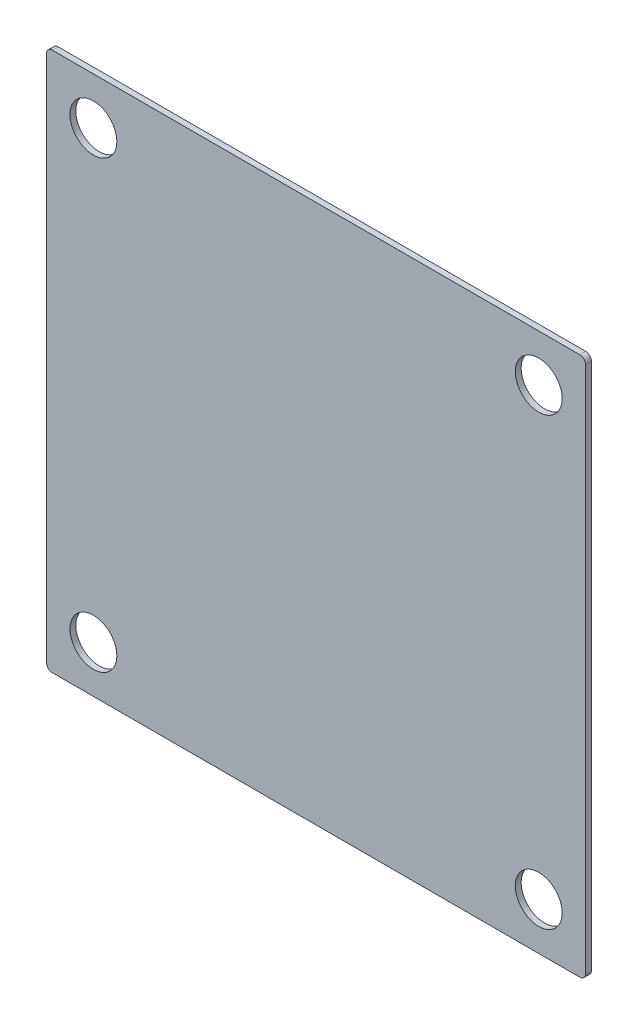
ISO-10303-21;
HEADER;
FILE_DESCRIPTION(('STEP AP214'),'2;1');
FILE_NAME('part.step','',(''),(''),'','','');
FILE_SCHEMA(('AUTOMOTIVE_DESIGN { 1 0 10303 214 1 1 1 1 }'));
ENDSEC;
DATA;
#1=APPLICATION_CONTEXT('core data for automotive mechanical design processes');
#2=APPLICATION_PROTOCOL_DEFINITION('international standard','automotive_design',2000,#1);
#3=PRODUCT_CONTEXT('',#1,'mechanical');
#4=PRODUCT('Part','Part','',(#3));
#5=PRODUCT_RELATED_PRODUCT_CATEGORY('part','',(#4));
#6=PRODUCT_DEFINITION_FORMATION('','',#4);
#7=PRODUCT_DEFINITION_CONTEXT('part definition',#1,'design');
#8=PRODUCT_DEFINITION('design','',#6,#7);
#9=PRODUCT_DEFINITION_SHAPE('','',#8);
#10=(LENGTH_UNIT() NAMED_UNIT(*) SI_UNIT(.MILLI.,.METRE.));
#11=(NAMED_UNIT(*) PLANE_ANGLE_UNIT() SI_UNIT($,.RADIAN.));
#12=(NAMED_UNIT(*) SI_UNIT($,.STERADIAN.) SOLID_ANGLE_UNIT());
#13=UNCERTAINTY_MEASURE_WITH_UNIT(LENGTH_MEASURE(1.E-05),#10,'distance_accuracy_value','');
#14=(GEOMETRIC_REPRESENTATION_CONTEXT(3) GLOBAL_UNCERTAINTY_ASSIGNED_CONTEXT((#13)) GLOBAL_UNIT_ASSIGNED_CONTEXT((#10,
#11,#12)) REPRESENTATION_CONTEXT('',''));
#15=CARTESIAN_POINT('',(0.,0.,0.));
#16=DIRECTION('',(0.,0.,1.));
#17=DIRECTION('',(1.,0.,0.));
#18=AXIS2_PLACEMENT_3D('',#15,#16,#17);
#19=CARTESIAN_POINT('',(-71.4375,-71.4375,1.5875));
#20=DIRECTION('',(0.,0.,1.));
#21=DIRECTION('',(1.,0.,0.));
#22=AXIS2_PLACEMENT_3D('',#19,#20,#21);
#23=PLANE('',#22);
#24=CARTESIAN_POINT('',(60.325,60.325,1.5875));
#25=DIRECTION('',(0.,0.,1.));
#26=DIRECTION('',(1.,0.,0.));
#27=AXIS2_PLACEMENT_3D('',#24,#25,#26);
#28=CIRCLE('',#27,6.35);
#29=CARTESIAN_POINT('',(66.675,60.325,1.5875));
#30=VERTEX_POINT('',#29);
#31=EDGE_CURVE('E195',#30,#30,#28,.T.);
#32=ORIENTED_EDGE('',*,*,#31,.F.);
#33=EDGE_LOOP('',(#32));
#34=FACE_BOUND('',#33,.T.);
#35=CARTESIAN_POINT('',(-60.325,-60.325,1.5875));
#36=DIRECTION('',(0.,0.,1.));
#37=DIRECTION('',(1.,0.,0.));
#38=AXIS2_PLACEMENT_3D('',#35,#36,#37);
#39=CIRCLE('',#38,6.35);
#40=CARTESIAN_POINT('',(-53.975,-60.325,1.5875));
#41=VERTEX_POINT('',#40);
#42=EDGE_CURVE('E141',#41,#41,#39,.T.);
#43=ORIENTED_EDGE('',*,*,#42,.F.);
#44=EDGE_LOOP('',(#43));
#45=FACE_BOUND('',#44,.T.);
#46=CARTESIAN_POINT('',(-71.4375,-71.4375,1.5875));
#47=DIRECTION('',(0.,0.,1.));
#48=DIRECTION('',(1.,0.,0.));
#49=AXIS2_PLACEMENT_3D('',#46,#47,#48);
#50=CIRCLE('',#49,1.58750000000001);
#51=CARTESIAN_POINT('',(-73.025,-71.4375,1.5875));
#52=VERTEX_POINT('',#51);
#53=CARTESIAN_POINT('',(-71.4375,-73.025,1.5875));
#54=VERTEX_POINT('',#53);
#55=EDGE_CURVE('E152',#52,#54,#50,.T.);
#56=ORIENTED_EDGE('',*,*,#55,.T.);
#57=DIRECTION('',(1.,0.,0.));
#58=VECTOR('',#57,1.);
#59=CARTESIAN_POINT('',(-71.4375,-73.025,1.5875));
#60=LINE('',#59,#58);
#61=CARTESIAN_POINT('',(71.4375,-73.025,1.5875));
#62=VERTEX_POINT('',#61);
#63=EDGE_CURVE('E100',#54,#62,#60,.T.);
#64=ORIENTED_EDGE('',*,*,#63,.T.);
#65=CARTESIAN_POINT('',(71.4375,-71.4375,1.5875));
#66=DIRECTION('',(0.,0.,1.));
#67=DIRECTION('',(1.,0.,0.));
#68=AXIS2_PLACEMENT_3D('',#65,#66,#67);
#69=CIRCLE('',#68,1.58750000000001);
#70=CARTESIAN_POINT('',(73.025,-71.4375,1.5875));
#71=VERTEX_POINT('',#70);
#72=EDGE_CURVE('E167',#62,#71,#69,.T.);
#73=ORIENTED_EDGE('',*,*,#72,.T.);
#74=DIRECTION('',(0.,1.,0.));
#75=VECTOR('',#74,1.);
#76=CARTESIAN_POINT('',(73.025,71.4375,1.5875));
#77=LINE('',#76,#75);
#78=CARTESIAN_POINT('',(73.025,71.4375,1.5875));
#79=VERTEX_POINT('',#78);
#80=EDGE_CURVE('E180',#71,#79,#77,.T.);
#81=ORIENTED_EDGE('',*,*,#80,.T.);
#82=CARTESIAN_POINT('',(71.4375,71.4375,1.5875));
#83=DIRECTION('',(0.,0.,1.));
#84=DIRECTION('',(-1.,0.,0.));
#85=AXIS2_PLACEMENT_3D('',#82,#83,#84);
#86=CIRCLE('',#85,1.58750000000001);
#87=CARTESIAN_POINT('',(71.4375,73.025,1.5875));
#88=VERTEX_POINT('',#87);
#89=EDGE_CURVE('E119',#79,#88,#86,.T.);
#90=ORIENTED_EDGE('',*,*,#89,.T.);
#91=DIRECTION('',(-1.,0.,0.));
#92=VECTOR('',#91,1.);
#93=CARTESIAN_POINT('',(-71.4375,73.025,1.5875));
#94=LINE('',#93,#92);
#95=CARTESIAN_POINT('',(-71.4375,73.025,1.5875));
#96=VERTEX_POINT('',#95);
#97=EDGE_CURVE('E113',#88,#96,#94,.T.);
#98=ORIENTED_EDGE('',*,*,#97,.T.);
#99=CARTESIAN_POINT('',(-71.4375,71.4375,1.5875));
#100=DIRECTION('',(0.,0.,1.));
#101=DIRECTION('',(1.,0.,0.));
#102=AXIS2_PLACEMENT_3D('',#99,#100,#101);
#103=CIRCLE('',#102,1.58750000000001);
#104=CARTESIAN_POINT('',(-73.025,71.4375,1.5875));
#105=VERTEX_POINT('',#104);
#106=EDGE_CURVE('E117',#96,#105,#103,.T.);
#107=ORIENTED_EDGE('',*,*,#106,.T.);
#108=DIRECTION('',(0.,-1.,0.));
#109=VECTOR('',#108,1.);
#110=CARTESIAN_POINT('',(-73.025,71.4375,1.5875));
#111=LINE('',#110,#109);
#112=EDGE_CURVE('E57',#105,#52,#111,.T.);
#113=ORIENTED_EDGE('',*,*,#112,.T.);
#114=EDGE_LOOP('',(#56,#64,#73,#81,#90,#98,#107,#113));
#115=FACE_BOUND('',#114,.T.);
#116=CARTESIAN_POINT('',(60.325,-60.325,1.5875));
#117=DIRECTION('',(0.,0.,1.));
#118=DIRECTION('',(1.,0.,0.));
#119=AXIS2_PLACEMENT_3D('',#116,#117,#118);
#120=CIRCLE('',#119,6.35);
#121=CARTESIAN_POINT('',(66.675,-60.325,1.5875));
#122=VERTEX_POINT('',#121);
#123=EDGE_CURVE('E189',#122,#122,#120,.T.);
#124=ORIENTED_EDGE('',*,*,#123,.F.);
#125=EDGE_LOOP('',(#124));
#126=FACE_BOUND('',#125,.T.);
#127=CARTESIAN_POINT('',(-60.325,60.325,1.5875));
#128=DIRECTION('',(0.,0.,1.));
#129=DIRECTION('',(1.,0.,0.));
#130=AXIS2_PLACEMENT_3D('',#127,#128,#129);
#131=CIRCLE('',#130,6.35);
#132=CARTESIAN_POINT('',(-53.975,60.325,1.5875));
#133=VERTEX_POINT('',#132);
#134=EDGE_CURVE('E201',#133,#133,#131,.T.);
#135=ORIENTED_EDGE('',*,*,#134,.F.);
#136=EDGE_LOOP('',(#135));
#137=FACE_BOUND('',#136,.T.);
#138=ADVANCED_FACE('F40',(#34,#45,#115,#126,#137),#23,.T.);
#139=CARTESIAN_POINT('',(-71.4375,-71.4375,0.));
#140=DIRECTION('',(0.,0.,1.));
#141=DIRECTION('',(1.,0.,0.));
#142=AXIS2_PLACEMENT_3D('',#139,#140,#141);
#143=PLANE('',#142);
#144=CARTESIAN_POINT('',(-71.4375,-71.4375,0.));
#145=DIRECTION('',(0.,0.,1.));
#146=DIRECTION('',(1.,0.,0.));
#147=AXIS2_PLACEMENT_3D('',#144,#145,#146);
#148=CIRCLE('',#147,1.58750000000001);
#149=CARTESIAN_POINT('',(-73.025,-71.4375,0.));
#150=VERTEX_POINT('',#149);
#151=CARTESIAN_POINT('',(-71.4375,-73.025,0.));
#152=VERTEX_POINT('',#151);
#153=EDGE_CURVE('E137',#150,#152,#148,.T.);
#154=ORIENTED_EDGE('',*,*,#153,.F.);
#155=DIRECTION('',(0.,-1.,0.));
#156=VECTOR('',#155,1.);
#157=CARTESIAN_POINT('',(-73.025,71.4375,0.));
#158=LINE('',#157,#156);
#159=CARTESIAN_POINT('',(-73.025,71.4375,0.));
#160=VERTEX_POINT('',#159);
#161=EDGE_CURVE('E92',#160,#150,#158,.T.);
#162=ORIENTED_EDGE('',*,*,#161,.F.);
#163=CARTESIAN_POINT('',(-71.4375,71.4375,0.));
#164=DIRECTION('',(0.,0.,1.));
#165=DIRECTION('',(1.,0.,0.));
#166=AXIS2_PLACEMENT_3D('',#163,#164,#165);
#167=CIRCLE('',#166,1.58750000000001);
#168=CARTESIAN_POINT('',(-71.4375,73.025,0.));
#169=VERTEX_POINT('',#168);
#170=EDGE_CURVE('E86',#169,#160,#167,.T.);
#171=ORIENTED_EDGE('',*,*,#170,.F.);
#172=DIRECTION('',(-1.,0.,0.));
#173=VECTOR('',#172,1.);
#174=CARTESIAN_POINT('',(-71.4375,73.025,0.));
#175=LINE('',#174,#173);
#176=CARTESIAN_POINT('',(71.4375,73.025,0.));
#177=VERTEX_POINT('',#176);
#178=EDGE_CURVE('E127',#177,#169,#175,.T.);
#179=ORIENTED_EDGE('',*,*,#178,.F.);
#180=CARTESIAN_POINT('',(71.4375,71.4375,0.));
#181=DIRECTION('',(0.,0.,1.));
#182=DIRECTION('',(-1.,0.,0.));
#183=AXIS2_PLACEMENT_3D('',#180,#181,#182);
#184=CIRCLE('',#183,1.58750000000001);
#185=CARTESIAN_POINT('',(73.025,71.4375,0.));
#186=VERTEX_POINT('',#185);
#187=EDGE_CURVE('E147',#186,#177,#184,.T.);
#188=ORIENTED_EDGE('',*,*,#187,.F.);
#189=DIRECTION('',(0.,1.,0.));
#190=VECTOR('',#189,1.);
#191=CARTESIAN_POINT('',(73.025,71.4375,0.));
#192=LINE('',#191,#190);
#193=CARTESIAN_POINT('',(73.025,-71.4375,0.));
#194=VERTEX_POINT('',#193);
#195=EDGE_CURVE('E145',#194,#186,#192,.T.);
#196=ORIENTED_EDGE('',*,*,#195,.F.);
#197=CARTESIAN_POINT('',(71.4375,-71.4375,0.));
#198=DIRECTION('',(0.,0.,1.));
#199=DIRECTION('',(1.,0.,0.));
#200=AXIS2_PLACEMENT_3D('',#197,#198,#199);
#201=CIRCLE('',#200,1.58750000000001);
#202=CARTESIAN_POINT('',(71.4375,-73.025,0.));
#203=VERTEX_POINT('',#202);
#204=EDGE_CURVE('E143',#203,#194,#201,.T.);
#205=ORIENTED_EDGE('',*,*,#204,.F.);
#206=DIRECTION('',(1.,0.,0.));
#207=VECTOR('',#206,1.);
#208=CARTESIAN_POINT('',(-71.4375,-73.025,0.));
#209=LINE('',#208,#207);
#210=EDGE_CURVE('E140',#152,#203,#209,.T.);
#211=ORIENTED_EDGE('',*,*,#210,.F.);
#212=EDGE_LOOP('',(#154,#162,#171,#179,#188,#196,#205,#211));
#213=FACE_BOUND('',#212,.T.);
#214=CARTESIAN_POINT('',(-60.325,-60.325,0.));
#215=DIRECTION('',(0.,0.,1.));
#216=DIRECTION('',(1.,0.,0.));
#217=AXIS2_PLACEMENT_3D('',#214,#215,#216);
#218=CIRCLE('',#217,6.35);
#219=CARTESIAN_POINT('',(-53.975,-60.325,0.));
#220=VERTEX_POINT('',#219);
#221=EDGE_CURVE('E186',#220,#220,#218,.T.);
#222=ORIENTED_EDGE('',*,*,#221,.T.);
#223=EDGE_LOOP('',(#222));
#224=FACE_BOUND('',#223,.T.);
#225=CARTESIAN_POINT('',(60.325,-60.325,0.));
#226=DIRECTION('',(0.,0.,1.));
#227=DIRECTION('',(1.,0.,0.));
#228=AXIS2_PLACEMENT_3D('',#225,#226,#227);
#229=CIRCLE('',#228,6.35);
#230=CARTESIAN_POINT('',(66.675,-60.325,0.));
#231=VERTEX_POINT('',#230);
#232=EDGE_CURVE('E192',#231,#231,#229,.T.);
#233=ORIENTED_EDGE('',*,*,#232,.T.);
#234=EDGE_LOOP('',(#233));
#235=FACE_BOUND('',#234,.T.);
#236=CARTESIAN_POINT('',(60.325,60.325,0.));
#237=DIRECTION('',(0.,0.,1.));
#238=DIRECTION('',(1.,0.,0.));
#239=AXIS2_PLACEMENT_3D('',#236,#237,#238);
#240=CIRCLE('',#239,6.35);
#241=CARTESIAN_POINT('',(66.675,60.325,0.));
#242=VERTEX_POINT('',#241);
#243=EDGE_CURVE('E198',#242,#242,#240,.T.);
#244=ORIENTED_EDGE('',*,*,#243,.T.);
#245=EDGE_LOOP('',(#244));
#246=FACE_BOUND('',#245,.T.);
#247=CARTESIAN_POINT('',(-60.325,60.325,0.));
#248=DIRECTION('',(0.,0.,1.));
#249=DIRECTION('',(1.,0.,0.));
#250=AXIS2_PLACEMENT_3D('',#247,#248,#249);
#251=CIRCLE('',#250,6.35);
#252=CARTESIAN_POINT('',(-53.975,60.325,0.));
#253=VERTEX_POINT('',#252);
#254=EDGE_CURVE('E204',#253,#253,#251,.T.);
#255=ORIENTED_EDGE('',*,*,#254,.T.);
#256=EDGE_LOOP('',(#255));
#257=FACE_BOUND('',#256,.T.);
#258=ADVANCED_FACE('F171',(#213,#224,#235,#246,#257),#143,.F.);
#259=CARTESIAN_POINT('',(-71.4375,-71.4375,1.5875));
#260=DIRECTION('',(0.,0.,-1.));
#261=DIRECTION('',(-1.,0.,0.));
#262=AXIS2_PLACEMENT_3D('',#259,#260,#261);
#263=CYLINDRICAL_SURFACE('',#262,1.58750000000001);
#264=ORIENTED_EDGE('',*,*,#153,.T.);
#265=DIRECTION('',(0.,0.,-1.));
#266=VECTOR('',#265,1.);
#267=CARTESIAN_POINT('',(-71.4375,-73.025,1.5875));
#268=LINE('',#267,#266);
#269=EDGE_CURVE('E11',#54,#152,#268,.T.);
#270=ORIENTED_EDGE('',*,*,#269,.F.);
#271=ORIENTED_EDGE('',*,*,#55,.F.);
#272=DIRECTION('',(0.,0.,-1.));
#273=VECTOR('',#272,1.);
#274=CARTESIAN_POINT('',(-73.025,-71.4375,1.5875));
#275=LINE('',#274,#273);
#276=EDGE_CURVE('E133',#52,#150,#275,.T.);
#277=ORIENTED_EDGE('',*,*,#276,.T.);
#278=EDGE_LOOP('',(#264,#270,#271,#277));
#279=FACE_BOUND('',#278,.T.);
#280=ADVANCED_FACE('F42',(#279),#263,.T.);
#281=CARTESIAN_POINT('',(-71.4375,-73.025,1.5875));
#282=DIRECTION('',(0.,1.,0.));
#283=DIRECTION('',(0.,0.,1.));
#284=AXIS2_PLACEMENT_3D('',#281,#282,#283);
#285=PLANE('',#284);
#286=ORIENTED_EDGE('',*,*,#210,.T.);
#287=DIRECTION('',(0.,0.,-1.));
#288=VECTOR('',#287,1.);
#289=CARTESIAN_POINT('',(71.4375,-73.025,1.5875));
#290=LINE('',#289,#288);
#291=EDGE_CURVE('E49',#62,#203,#290,.T.);
#292=ORIENTED_EDGE('',*,*,#291,.F.);
#293=ORIENTED_EDGE('',*,*,#63,.F.);
#294=ORIENTED_EDGE('',*,*,#269,.T.);
#295=EDGE_LOOP('',(#286,#292,#293,#294));
#296=FACE_BOUND('',#295,.T.);
#297=ADVANCED_FACE('F238',(#296),#285,.F.);
#298=CARTESIAN_POINT('',(71.4375,-71.4375,1.5875));
#299=DIRECTION('',(0.,0.,-1.));
#300=DIRECTION('',(-1.,0.,0.));
#301=AXIS2_PLACEMENT_3D('',#298,#299,#300);
#302=CYLINDRICAL_SURFACE('',#301,1.58750000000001);
#303=ORIENTED_EDGE('',*,*,#204,.T.);
#304=DIRECTION('',(0.,0.,-1.));
#305=VECTOR('',#304,1.);
#306=CARTESIAN_POINT('',(73.025,-71.4375,1.5875));
#307=LINE('',#306,#305);
#308=EDGE_CURVE('E159',#71,#194,#307,.T.);
#309=ORIENTED_EDGE('',*,*,#308,.F.);
#310=ORIENTED_EDGE('',*,*,#72,.F.);
#311=ORIENTED_EDGE('',*,*,#291,.T.);
#312=EDGE_LOOP('',(#303,#309,#310,#311));
#313=FACE_BOUND('',#312,.T.);
#314=ADVANCED_FACE('F165',(#313),#302,.T.);
#315=CARTESIAN_POINT('',(73.025,71.4375,1.5875));
#316=DIRECTION('',(-1.,0.,0.));
#317=DIRECTION('',(0.,0.,1.));
#318=AXIS2_PLACEMENT_3D('',#315,#316,#317);
#319=PLANE('',#318);
#320=ORIENTED_EDGE('',*,*,#195,.T.);
#321=DIRECTION('',(0.,0.,-1.));
#322=VECTOR('',#321,1.);
#323=CARTESIAN_POINT('',(73.025,71.4375,1.5875));
#324=LINE('',#323,#322);
#325=EDGE_CURVE('E156',#79,#186,#324,.T.);
#326=ORIENTED_EDGE('',*,*,#325,.F.);
#327=ORIENTED_EDGE('',*,*,#80,.F.);
#328=ORIENTED_EDGE('',*,*,#308,.T.);
#329=EDGE_LOOP('',(#320,#326,#327,#328));
#330=FACE_BOUND('',#329,.T.);
#331=ADVANCED_FACE('F176',(#330),#319,.F.);
#332=CARTESIAN_POINT('',(71.4375,71.4375,1.5875));
#333=DIRECTION('',(0.,0.,-1.));
#334=DIRECTION('',(-1.,0.,0.));
#335=AXIS2_PLACEMENT_3D('',#332,#333,#334);
#336=CYLINDRICAL_SURFACE('',#335,1.58750000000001);
#337=ORIENTED_EDGE('',*,*,#187,.T.);
#338=DIRECTION('',(0.,0.,-1.));
#339=VECTOR('',#338,1.);
#340=CARTESIAN_POINT('',(71.4375,73.025,1.5875));
#341=LINE('',#340,#339);
#342=EDGE_CURVE('E128',#88,#177,#341,.T.);
#343=ORIENTED_EDGE('',*,*,#342,.F.);
#344=ORIENTED_EDGE('',*,*,#89,.F.);
#345=ORIENTED_EDGE('',*,*,#325,.T.);
#346=EDGE_LOOP('',(#337,#343,#344,#345));
#347=FACE_BOUND('',#346,.T.);
#348=ADVANCED_FACE('F179',(#347),#336,.T.);
#349=CARTESIAN_POINT('',(-71.4375,73.025,1.5875));
#350=DIRECTION('',(0.,-1.,0.));
#351=DIRECTION('',(0.,0.,-1.));
#352=AXIS2_PLACEMENT_3D('',#349,#350,#351);
#353=PLANE('',#352);
#354=ORIENTED_EDGE('',*,*,#178,.T.);
#355=DIRECTION('',(0.,0.,-1.));
#356=VECTOR('',#355,1.);
#357=CARTESIAN_POINT('',(-71.4375,73.025,1.5875));
#358=LINE('',#357,#356);
#359=EDGE_CURVE('E124',#96,#169,#358,.T.);
#360=ORIENTED_EDGE('',*,*,#359,.F.);
#361=ORIENTED_EDGE('',*,*,#97,.F.);
#362=ORIENTED_EDGE('',*,*,#342,.T.);
#363=EDGE_LOOP('',(#354,#360,#361,#362));
#364=FACE_BOUND('',#363,.T.);
#365=ADVANCED_FACE('F125',(#364),#353,.F.);
#366=CARTESIAN_POINT('',(-71.4375,71.4375,1.5875));
#367=DIRECTION('',(0.,0.,-1.));
#368=DIRECTION('',(-1.,0.,0.));
#369=AXIS2_PLACEMENT_3D('',#366,#367,#368);
#370=CYLINDRICAL_SURFACE('',#369,1.58750000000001);
#371=ORIENTED_EDGE('',*,*,#170,.T.);
#372=DIRECTION('',(0.,0.,-1.));
#373=VECTOR('',#372,1.);
#374=CARTESIAN_POINT('',(-73.025,71.4375,1.5875));
#375=LINE('',#374,#373);
#376=EDGE_CURVE('E129',#105,#160,#375,.T.);
#377=ORIENTED_EDGE('',*,*,#376,.F.);
#378=ORIENTED_EDGE('',*,*,#106,.F.);
#379=ORIENTED_EDGE('',*,*,#359,.T.);
#380=EDGE_LOOP('',(#371,#377,#378,#379));
#381=FACE_BOUND('',#380,.T.);
#382=ADVANCED_FACE('F131',(#381),#370,.T.);
#383=CARTESIAN_POINT('',(-73.025,71.4375,1.5875));
#384=DIRECTION('',(1.,0.,0.));
#385=DIRECTION('',(0.,0.,-1.));
#386=AXIS2_PLACEMENT_3D('',#383,#384,#385);
#387=PLANE('',#386);
#388=ORIENTED_EDGE('',*,*,#161,.T.);
#389=ORIENTED_EDGE('',*,*,#276,.F.);
#390=ORIENTED_EDGE('',*,*,#112,.F.);
#391=ORIENTED_EDGE('',*,*,#376,.T.);
#392=EDGE_LOOP('',(#388,#389,#390,#391));
#393=FACE_BOUND('',#392,.T.);
#394=ADVANCED_FACE('F226',(#393),#387,.F.);
#395=CARTESIAN_POINT('',(-60.325,-60.325,1.5875));
#396=DIRECTION('',(0.,0.,-1.));
#397=DIRECTION('',(-1.,0.,0.));
#398=AXIS2_PLACEMENT_3D('',#395,#396,#397);
#399=CYLINDRICAL_SURFACE('',#398,6.35);
#400=ORIENTED_EDGE('',*,*,#42,.T.);
#401=EDGE_LOOP('',(#400));
#402=FACE_BOUND('',#401,.T.);
#403=ORIENTED_EDGE('',*,*,#221,.F.);
#404=EDGE_LOOP('',(#403));
#405=FACE_BOUND('',#404,.T.);
#406=ADVANCED_FACE('F223',(#402,#405),#399,.F.);
#407=CARTESIAN_POINT('',(60.325,-60.325,1.5875));
#408=DIRECTION('',(0.,0.,-1.));
#409=DIRECTION('',(-1.,0.,0.));
#410=AXIS2_PLACEMENT_3D('',#407,#408,#409);
#411=CYLINDRICAL_SURFACE('',#410,6.35);
#412=ORIENTED_EDGE('',*,*,#123,.T.);
#413=EDGE_LOOP('',(#412));
#414=FACE_BOUND('',#413,.T.);
#415=ORIENTED_EDGE('',*,*,#232,.F.);
#416=EDGE_LOOP('',(#415));
#417=FACE_BOUND('',#416,.T.);
#418=ADVANCED_FACE('F301',(#414,#417),#411,.F.);
#419=CARTESIAN_POINT('',(60.325,60.325,1.5875));
#420=DIRECTION('',(0.,0.,-1.));
#421=DIRECTION('',(-1.,0.,0.));
#422=AXIS2_PLACEMENT_3D('',#419,#420,#421);
#423=CYLINDRICAL_SURFACE('',#422,6.35);
#424=ORIENTED_EDGE('',*,*,#31,.T.);
#425=EDGE_LOOP('',(#424));
#426=FACE_BOUND('',#425,.T.);
#427=ORIENTED_EDGE('',*,*,#243,.F.);
#428=EDGE_LOOP('',(#427));
#429=FACE_BOUND('',#428,.T.);
#430=ADVANCED_FACE('F309',(#426,#429),#423,.F.);
#431=CARTESIAN_POINT('',(-60.325,60.325,1.5875));
#432=DIRECTION('',(0.,0.,-1.));
#433=DIRECTION('',(-1.,0.,0.));
#434=AXIS2_PLACEMENT_3D('',#431,#432,#433);
#435=CYLINDRICAL_SURFACE('',#434,6.35);
#436=ORIENTED_EDGE('',*,*,#134,.T.);
#437=EDGE_LOOP('',(#436));
#438=FACE_BOUND('',#437,.T.);
#439=ORIENTED_EDGE('',*,*,#254,.F.);
#440=EDGE_LOOP('',(#439));
#441=FACE_BOUND('',#440,.T.);
#442=ADVANCED_FACE('F210',(#438,#441),#435,.F.);
#443=CLOSED_SHELL('',(#138,#258,#280,#297,#314,#331,#348,#365,#382,#394,#406,#418,#430,#442));
#444=MANIFOLD_SOLID_BREP('B2',#443);
#445=ADVANCED_BREP_SHAPE_REPRESENTATION('',(#18,#444),#14);
#446=SHAPE_DEFINITION_REPRESENTATION(#9,#445);
ENDSEC;
END-ISO-10303-21;
